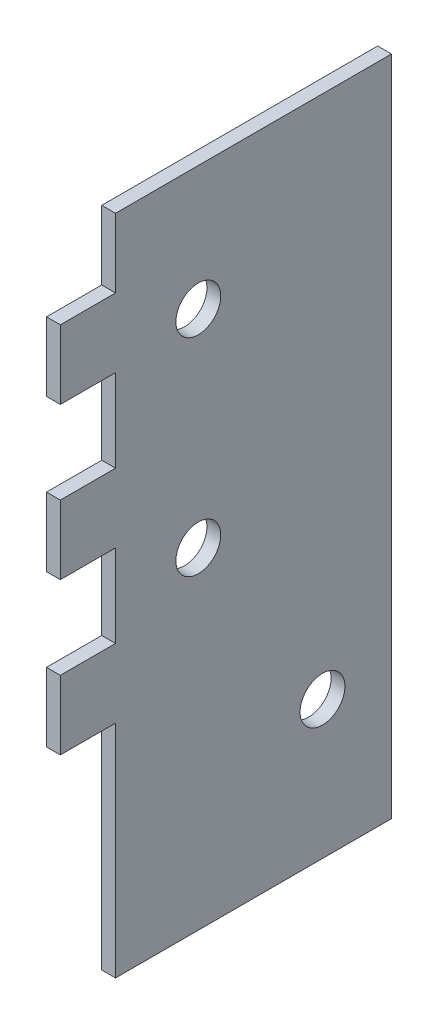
ISO-10303-21;
HEADER;
FILE_DESCRIPTION(('STEP AP214'),'2;1');
FILE_NAME('part.step','',(''),(''),'','','');
FILE_SCHEMA(('AUTOMOTIVE_DESIGN { 1 0 10303 214 1 1 1 1 }'));
ENDSEC;
DATA;
#1=APPLICATION_CONTEXT('core data for automotive mechanical design processes');
#2=APPLICATION_PROTOCOL_DEFINITION('international standard','automotive_design',2000,#1);
#3=PRODUCT_CONTEXT('',#1,'mechanical');
#4=PRODUCT('Part','Part','',(#3));
#5=PRODUCT_RELATED_PRODUCT_CATEGORY('part','',(#4));
#6=PRODUCT_DEFINITION_FORMATION('','',#4);
#7=PRODUCT_DEFINITION_CONTEXT('part definition',#1,'design');
#8=PRODUCT_DEFINITION('design','',#6,#7);
#9=PRODUCT_DEFINITION_SHAPE('','',#8);
#10=(LENGTH_UNIT() NAMED_UNIT(*) SI_UNIT(.MILLI.,.METRE.));
#11=(NAMED_UNIT(*) PLANE_ANGLE_UNIT() SI_UNIT($,.RADIAN.));
#12=(NAMED_UNIT(*) SI_UNIT($,.STERADIAN.) SOLID_ANGLE_UNIT());
#13=UNCERTAINTY_MEASURE_WITH_UNIT(LENGTH_MEASURE(1.E-05),#10,'distance_accuracy_value','');
#14=(GEOMETRIC_REPRESENTATION_CONTEXT(3) GLOBAL_UNCERTAINTY_ASSIGNED_CONTEXT((#13)) GLOBAL_UNIT_ASSIGNED_CONTEXT((#10,
#11,#12)) REPRESENTATION_CONTEXT('',''));
#15=CARTESIAN_POINT('',(0.,0.,0.));
#16=DIRECTION('',(0.,0.,1.));
#17=DIRECTION('',(1.,0.,0.));
#18=AXIS2_PLACEMENT_3D('',#15,#16,#17);
#19=CARTESIAN_POINT('',(-3.17499999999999,304.8,63.5));
#20=DIRECTION('',(0.,0.,-1.));
#21=DIRECTION('',(-1.,0.,0.));
#22=AXIS2_PLACEMENT_3D('',#19,#20,#21);
#23=PLANE('',#22);
#24=DIRECTION('',(1.,0.,0.));
#25=VECTOR('',#24,1.);
#26=CARTESIAN_POINT('',(-3.17499999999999,101.6,63.5));
#27=LINE('',#26,#25);
#28=CARTESIAN_POINT('',(-3.17499999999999,101.6,63.5));
#29=VERTEX_POINT('',#28);
#30=CARTESIAN_POINT('',(3.17500000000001,101.6,63.5));
#31=VERTEX_POINT('',#30);
#32=EDGE_CURVE('E336',#29,#31,#27,.T.);
#33=ORIENTED_EDGE('',*,*,#32,.F.);
#34=DIRECTION('',(0.,-1.,0.));
#35=VECTOR('',#34,1.);
#36=CARTESIAN_POINT('',(-3.17499999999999,304.8,63.5));
#37=LINE('',#36,#35);
#38=CARTESIAN_POINT('',(-3.17499999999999,0.,63.5));
#39=VERTEX_POINT('',#38);
#40=EDGE_CURVE('E170',#29,#39,#37,.T.);
#41=ORIENTED_EDGE('',*,*,#40,.T.);
#42=DIRECTION('',(1.,0.,0.));
#43=VECTOR('',#42,1.);
#44=CARTESIAN_POINT('',(-3.17499999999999,0.,63.5));
#45=LINE('',#44,#43);
#46=CARTESIAN_POINT('',(3.17500000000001,0.,63.5));
#47=VERTEX_POINT('',#46);
#48=EDGE_CURVE('E244',#39,#47,#45,.T.);
#49=ORIENTED_EDGE('',*,*,#48,.T.);
#50=DIRECTION('',(0.,-1.,0.));
#51=VECTOR('',#50,1.);
#52=CARTESIAN_POINT('',(3.17500000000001,304.8,63.5));
#53=LINE('',#52,#51);
#54=EDGE_CURVE('E49',#31,#47,#53,.T.);
#55=ORIENTED_EDGE('',*,*,#54,.F.);
#56=EDGE_LOOP('',(#33,#41,#49,#55));
#57=FACE_BOUND('',#56,.T.);
#58=ADVANCED_FACE('F32',(#57),#23,.F.);
#59=DIRECTION('',(-1.,0.,0.));
#60=VECTOR('',#59,1.);
#61=CARTESIAN_POINT('',(-3.17499999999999,133.35,63.5));
#62=LINE('',#61,#60);
#63=CARTESIAN_POINT('',(3.17500000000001,133.35,63.5));
#64=VERTEX_POINT('',#63);
#65=CARTESIAN_POINT('',(-3.17499999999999,133.35,63.5));
#66=VERTEX_POINT('',#65);
#67=EDGE_CURVE('E57',#64,#66,#62,.T.);
#68=ORIENTED_EDGE('',*,*,#67,.F.);
#69=CARTESIAN_POINT('',(3.17500000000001,171.45,63.5));
#70=VERTEX_POINT('',#69);
#71=EDGE_CURVE('E342',#70,#64,#53,.T.);
#72=ORIENTED_EDGE('',*,*,#71,.F.);
#73=DIRECTION('',(1.,0.,0.));
#74=VECTOR('',#73,1.);
#75=CARTESIAN_POINT('',(-3.17499999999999,171.45,63.5));
#76=LINE('',#75,#74);
#77=CARTESIAN_POINT('',(-3.17499999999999,171.45,63.5));
#78=VERTEX_POINT('',#77);
#79=EDGE_CURVE('E171',#78,#70,#76,.T.);
#80=ORIENTED_EDGE('',*,*,#79,.F.);
#81=EDGE_CURVE('E332',#78,#66,#37,.T.);
#82=ORIENTED_EDGE('',*,*,#81,.T.);
#83=EDGE_LOOP('',(#68,#72,#80,#82));
#84=FACE_BOUND('',#83,.T.);
#85=ADVANCED_FACE('F293',(#84),#23,.F.);
#86=DIRECTION('',(-1.,0.,0.));
#87=VECTOR('',#86,1.);
#88=CARTESIAN_POINT('',(-3.17499999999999,203.2,63.5));
#89=LINE('',#88,#87);
#90=CARTESIAN_POINT('',(3.17500000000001,203.2,63.5));
#91=VERTEX_POINT('',#90);
#92=CARTESIAN_POINT('',(-3.17499999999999,203.2,63.5));
#93=VERTEX_POINT('',#92);
#94=EDGE_CURVE('E174',#91,#93,#89,.T.);
#95=ORIENTED_EDGE('',*,*,#94,.F.);
#96=CARTESIAN_POINT('',(3.17500000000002,241.3,63.5));
#97=VERTEX_POINT('',#96);
#98=EDGE_CURVE('E261',#97,#91,#53,.T.);
#99=ORIENTED_EDGE('',*,*,#98,.F.);
#100=DIRECTION('',(1.,0.,0.));
#101=VECTOR('',#100,1.);
#102=CARTESIAN_POINT('',(-3.17499999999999,241.3,63.5));
#103=LINE('',#102,#101);
#104=CARTESIAN_POINT('',(-3.17499999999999,241.3,63.5));
#105=VERTEX_POINT('',#104);
#106=EDGE_CURVE('E203',#105,#97,#103,.T.);
#107=ORIENTED_EDGE('',*,*,#106,.F.);
#108=EDGE_CURVE('E264',#105,#93,#37,.T.);
#109=ORIENTED_EDGE('',*,*,#108,.T.);
#110=EDGE_LOOP('',(#95,#99,#107,#109));
#111=FACE_BOUND('',#110,.T.);
#112=ADVANCED_FACE('F299',(#111),#23,.F.);
#113=DIRECTION('',(-1.,0.,0.));
#114=VECTOR('',#113,1.);
#115=CARTESIAN_POINT('',(-3.17499999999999,273.05,63.5));
#116=LINE('',#115,#114);
#117=CARTESIAN_POINT('',(3.17500000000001,273.05,63.5));
#118=VERTEX_POINT('',#117);
#119=CARTESIAN_POINT('',(-3.17499999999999,273.05,63.5));
#120=VERTEX_POINT('',#119);
#121=EDGE_CURVE('E208',#118,#120,#116,.T.);
#122=ORIENTED_EDGE('',*,*,#121,.F.);
#123=CARTESIAN_POINT('',(3.17500000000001,304.8,63.5));
#124=VERTEX_POINT('',#123);
#125=EDGE_CURVE('E258',#124,#118,#53,.T.);
#126=ORIENTED_EDGE('',*,*,#125,.F.);
#127=DIRECTION('',(1.,0.,0.));
#128=VECTOR('',#127,1.);
#129=CARTESIAN_POINT('',(-3.17499999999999,304.8,63.5));
#130=LINE('',#129,#128);
#131=CARTESIAN_POINT('',(-3.17499999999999,304.8,63.5));
#132=VERTEX_POINT('',#131);
#133=EDGE_CURVE('E248',#132,#124,#130,.T.);
#134=ORIENTED_EDGE('',*,*,#133,.F.);
#135=EDGE_CURVE('E262',#132,#120,#37,.T.);
#136=ORIENTED_EDGE('',*,*,#135,.T.);
#137=EDGE_LOOP('',(#122,#126,#134,#136));
#138=FACE_BOUND('',#137,.T.);
#139=ADVANCED_FACE('F295',(#138),#23,.F.);
#140=CARTESIAN_POINT('',(3.17499999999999,304.8,-63.5));
#141=DIRECTION('',(-1.,0.,0.));
#142=DIRECTION('',(0.,0.,1.));
#143=AXIS2_PLACEMENT_3D('',#140,#141,#142);
#144=PLANE('',#143);
#145=CARTESIAN_POINT('',(3.175,247.65,25.4));
#146=DIRECTION('',(1.,0.,0.));
#147=DIRECTION('',(0.,0.,-1.));
#148=AXIS2_PLACEMENT_3D('',#145,#146,#147);
#149=CIRCLE('',#148,10.31875);
#150=CARTESIAN_POINT('',(3.17499999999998,247.65,15.08125));
#151=VERTEX_POINT('',#150);
#152=EDGE_CURVE('E231',#151,#151,#149,.T.);
#153=ORIENTED_EDGE('',*,*,#152,.F.);
#154=EDGE_LOOP('',(#153));
#155=FACE_BOUND('',#154,.T.);
#156=CARTESIAN_POINT('',(3.175,152.4,25.4));
#157=DIRECTION('',(1.,0.,0.));
#158=DIRECTION('',(0.,0.,-1.));
#159=AXIS2_PLACEMENT_3D('',#156,#157,#158);
#160=CIRCLE('',#159,10.31875);
#161=CARTESIAN_POINT('',(3.17499999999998,152.4,15.08125));
#162=VERTEX_POINT('',#161);
#163=EDGE_CURVE('E235',#162,#162,#160,.T.);
#164=ORIENTED_EDGE('',*,*,#163,.F.);
#165=EDGE_LOOP('',(#164));
#166=FACE_BOUND('',#165,.T.);
#167=CARTESIAN_POINT('',(3.175,63.5,-31.75));
#168=DIRECTION('',(1.,0.,0.));
#169=DIRECTION('',(0.,0.,-1.));
#170=AXIS2_PLACEMENT_3D('',#167,#168,#169);
#171=CIRCLE('',#170,10.31875);
#172=CARTESIAN_POINT('',(3.17499999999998,63.5,-42.06875));
#173=VERTEX_POINT('',#172);
#174=EDGE_CURVE('E230',#173,#173,#171,.T.);
#175=ORIENTED_EDGE('',*,*,#174,.F.);
#176=EDGE_LOOP('',(#175));
#177=FACE_BOUND('',#176,.T.);
#178=DIRECTION('',(0.,0.,-1.));
#179=VECTOR('',#178,1.);
#180=CARTESIAN_POINT('',(3.17499999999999,0.,-63.5));
#181=LINE('',#180,#179);
#182=CARTESIAN_POINT('',(3.17499999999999,0.,-63.5));
#183=VERTEX_POINT('',#182);
#184=EDGE_CURVE('E250',#47,#183,#181,.T.);
#185=ORIENTED_EDGE('',*,*,#184,.T.);
#186=DIRECTION('',(0.,-1.,0.));
#187=VECTOR('',#186,1.);
#188=CARTESIAN_POINT('',(3.17499999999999,304.8,-63.5));
#189=LINE('',#188,#187);
#190=CARTESIAN_POINT('',(3.17499999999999,304.8,-63.5));
#191=VERTEX_POINT('',#190);
#192=EDGE_CURVE('E11',#191,#183,#189,.T.);
#193=ORIENTED_EDGE('',*,*,#192,.F.);
#194=DIRECTION('',(0.,0.,-1.));
#195=VECTOR('',#194,1.);
#196=CARTESIAN_POINT('',(3.17499999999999,304.8,-63.5));
#197=LINE('',#196,#195);
#198=EDGE_CURVE('E240',#124,#191,#197,.T.);
#199=ORIENTED_EDGE('',*,*,#198,.F.);
#200=ORIENTED_EDGE('',*,*,#125,.T.);
#201=DIRECTION('',(0.,0.,-1.));
#202=VECTOR('',#201,1.);
#203=CARTESIAN_POINT('',(3.17500000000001,273.05,88.9));
#204=LINE('',#203,#202);
#205=CARTESIAN_POINT('',(3.17500000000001,273.05,88.9));
#206=VERTEX_POINT('',#205);
#207=EDGE_CURVE('E221',#206,#118,#204,.T.);
#208=ORIENTED_EDGE('',*,*,#207,.F.);
#209=DIRECTION('',(0.,1.,0.));
#210=VECTOR('',#209,1.);
#211=CARTESIAN_POINT('',(3.17500000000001,273.05,88.9));
#212=LINE('',#211,#210);
#213=CARTESIAN_POINT('',(3.17500000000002,241.3,88.9));
#214=VERTEX_POINT('',#213);
#215=EDGE_CURVE('E210',#214,#206,#212,.T.);
#216=ORIENTED_EDGE('',*,*,#215,.F.);
#217=DIRECTION('',(0.,0.,-1.));
#218=VECTOR('',#217,1.);
#219=CARTESIAN_POINT('',(3.17500000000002,241.3,88.9));
#220=LINE('',#219,#218);
#221=EDGE_CURVE('E224',#214,#97,#220,.T.);
#222=ORIENTED_EDGE('',*,*,#221,.T.);
#223=ORIENTED_EDGE('',*,*,#98,.T.);
#224=DIRECTION('',(0.,0.,-1.));
#225=VECTOR('',#224,1.);
#226=CARTESIAN_POINT('',(3.17500000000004,203.2,88.9));
#227=LINE('',#226,#225);
#228=CARTESIAN_POINT('',(3.17500000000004,203.2,88.9));
#229=VERTEX_POINT('',#228);
#230=EDGE_CURVE('E194',#229,#91,#227,.T.);
#231=ORIENTED_EDGE('',*,*,#230,.F.);
#232=DIRECTION('',(0.,1.,0.));
#233=VECTOR('',#232,1.);
#234=CARTESIAN_POINT('',(3.17500000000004,203.2,88.9));
#235=LINE('',#234,#233);
#236=CARTESIAN_POINT('',(3.17500000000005,171.45,88.9));
#237=VERTEX_POINT('',#236);
#238=EDGE_CURVE('E185',#237,#229,#235,.T.);
#239=ORIENTED_EDGE('',*,*,#238,.F.);
#240=DIRECTION('',(0.,0.,-1.));
#241=VECTOR('',#240,1.);
#242=CARTESIAN_POINT('',(3.17500000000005,171.45,88.9));
#243=LINE('',#242,#241);
#244=EDGE_CURVE('E197',#237,#70,#243,.T.);
#245=ORIENTED_EDGE('',*,*,#244,.T.);
#246=ORIENTED_EDGE('',*,*,#71,.T.);
#247=DIRECTION('',(0.,0.,-1.));
#248=VECTOR('',#247,1.);
#249=CARTESIAN_POINT('',(3.17500000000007,133.35,88.9));
#250=LINE('',#249,#248);
#251=CARTESIAN_POINT('',(3.17500000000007,133.35,88.9));
#252=VERTEX_POINT('',#251);
#253=EDGE_CURVE('E176',#252,#64,#250,.T.);
#254=ORIENTED_EDGE('',*,*,#253,.F.);
#255=DIRECTION('',(0.,1.,0.));
#256=VECTOR('',#255,1.);
#257=CARTESIAN_POINT('',(3.17500000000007,133.35,88.9));
#258=LINE('',#257,#256);
#259=CARTESIAN_POINT('',(3.17500000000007,101.6,88.9));
#260=VERTEX_POINT('',#259);
#261=EDGE_CURVE('E157',#260,#252,#258,.T.);
#262=ORIENTED_EDGE('',*,*,#261,.F.);
#263=DIRECTION('',(0.,0.,-1.));
#264=VECTOR('',#263,1.);
#265=CARTESIAN_POINT('',(3.17500000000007,101.6,88.9));
#266=LINE('',#265,#264);
#267=EDGE_CURVE('E154',#260,#31,#266,.T.);
#268=ORIENTED_EDGE('',*,*,#267,.T.);
#269=ORIENTED_EDGE('',*,*,#54,.T.);
#270=EDGE_LOOP('',(#185,#193,#199,#200,#208,#216,#222,#223,#231,#239,#245,#246,#254,#262,#268,#269));
#271=FACE_BOUND('',#270,.T.);
#272=ADVANCED_FACE('F34',(#155,#166,#177,#271),#144,.F.);
#273=CARTESIAN_POINT('',(-3.17500000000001,304.8,-63.5));
#274=DIRECTION('',(0.,0.,1.));
#275=DIRECTION('',(1.,0.,0.));
#276=AXIS2_PLACEMENT_3D('',#273,#274,#275);
#277=PLANE('',#276);
#278=DIRECTION('',(-1.,0.,0.));
#279=VECTOR('',#278,1.);
#280=CARTESIAN_POINT('',(-3.17500000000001,0.,-63.5));
#281=LINE('',#280,#279);
#282=CARTESIAN_POINT('',(-3.17500000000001,0.,-63.5));
#283=VERTEX_POINT('',#282);
#284=EDGE_CURVE('E253',#183,#283,#281,.T.);
#285=ORIENTED_EDGE('',*,*,#284,.T.);
#286=DIRECTION('',(0.,-1.,0.));
#287=VECTOR('',#286,1.);
#288=CARTESIAN_POINT('',(-3.17500000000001,304.8,-63.5));
#289=LINE('',#288,#287);
#290=CARTESIAN_POINT('',(-3.17500000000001,304.8,-63.5));
#291=VERTEX_POINT('',#290);
#292=EDGE_CURVE('E41',#291,#283,#289,.T.);
#293=ORIENTED_EDGE('',*,*,#292,.F.);
#294=DIRECTION('',(-1.,0.,0.));
#295=VECTOR('',#294,1.);
#296=CARTESIAN_POINT('',(-3.17500000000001,304.8,-63.5));
#297=LINE('',#296,#295);
#298=EDGE_CURVE('E243',#191,#291,#297,.T.);
#299=ORIENTED_EDGE('',*,*,#298,.F.);
#300=ORIENTED_EDGE('',*,*,#192,.T.);
#301=EDGE_LOOP('',(#285,#293,#299,#300));
#302=FACE_BOUND('',#301,.T.);
#303=ADVANCED_FACE('F308',(#302),#277,.F.);
#304=CARTESIAN_POINT('',(-3.17500000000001,304.8,-63.5));
#305=DIRECTION('',(1.,0.,0.));
#306=DIRECTION('',(0.,0.,-1.));
#307=AXIS2_PLACEMENT_3D('',#304,#305,#306);
#308=PLANE('',#307);
#309=CARTESIAN_POINT('',(-3.17500000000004,247.65,25.4));
#310=DIRECTION('',(1.,0.,0.));
#311=DIRECTION('',(0.,0.,-1.));
#312=AXIS2_PLACEMENT_3D('',#309,#310,#311);
#313=CIRCLE('',#312,10.31875);
#314=CARTESIAN_POINT('',(-3.17500000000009,247.65,15.08125));
#315=VERTEX_POINT('',#314);
#316=EDGE_CURVE('E36',#315,#315,#313,.T.);
#317=ORIENTED_EDGE('',*,*,#316,.T.);
#318=EDGE_LOOP('',(#317));
#319=FACE_BOUND('',#318,.T.);
#320=CARTESIAN_POINT('',(-3.17500000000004,152.4,25.4));
#321=DIRECTION('',(1.,0.,0.));
#322=DIRECTION('',(0.,0.,-1.));
#323=AXIS2_PLACEMENT_3D('',#320,#321,#322);
#324=CIRCLE('',#323,10.31875);
#325=CARTESIAN_POINT('',(-3.17500000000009,152.4,15.08125));
#326=VERTEX_POINT('',#325);
#327=EDGE_CURVE('E268',#326,#326,#324,.T.);
#328=ORIENTED_EDGE('',*,*,#327,.T.);
#329=EDGE_LOOP('',(#328));
#330=FACE_BOUND('',#329,.T.);
#331=CARTESIAN_POINT('',(-3.17500000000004,63.5,-31.75));
#332=DIRECTION('',(1.,0.,0.));
#333=DIRECTION('',(0.,0.,-1.));
#334=AXIS2_PLACEMENT_3D('',#331,#332,#333);
#335=CIRCLE('',#334,10.31875);
#336=CARTESIAN_POINT('',(-3.17500000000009,63.5,-42.06875));
#337=VERTEX_POINT('',#336);
#338=EDGE_CURVE('E234',#337,#337,#335,.T.);
#339=ORIENTED_EDGE('',*,*,#338,.T.);
#340=EDGE_LOOP('',(#339));
#341=FACE_BOUND('',#340,.T.);
#342=DIRECTION('',(0.,0.,1.));
#343=VECTOR('',#342,1.);
#344=CARTESIAN_POINT('',(-3.17500000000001,0.,-63.5));
#345=LINE('',#344,#343);
#346=EDGE_CURVE('E255',#283,#39,#345,.T.);
#347=ORIENTED_EDGE('',*,*,#346,.T.);
#348=ORIENTED_EDGE('',*,*,#40,.F.);
#349=DIRECTION('',(0.,0.,-1.));
#350=VECTOR('',#349,1.);
#351=CARTESIAN_POINT('',(-3.17499999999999,101.6,88.9));
#352=LINE('',#351,#350);
#353=CARTESIAN_POINT('',(-3.17499999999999,101.6,88.9));
#354=VERTEX_POINT('',#353);
#355=EDGE_CURVE('E152',#354,#29,#352,.T.);
#356=ORIENTED_EDGE('',*,*,#355,.F.);
#357=DIRECTION('',(0.,-1.,0.));
#358=VECTOR('',#357,1.);
#359=CARTESIAN_POINT('',(-3.17499999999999,133.35,88.9));
#360=LINE('',#359,#358);
#361=CARTESIAN_POINT('',(-3.17499999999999,133.35,88.9));
#362=VERTEX_POINT('',#361);
#363=EDGE_CURVE('E158',#362,#354,#360,.T.);
#364=ORIENTED_EDGE('',*,*,#363,.F.);
#365=DIRECTION('',(0.,0.,-1.));
#366=VECTOR('',#365,1.);
#367=CARTESIAN_POINT('',(-3.17499999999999,133.35,88.9));
#368=LINE('',#367,#366);
#369=EDGE_CURVE('E349',#362,#66,#368,.T.);
#370=ORIENTED_EDGE('',*,*,#369,.T.);
#371=ORIENTED_EDGE('',*,*,#81,.F.);
#372=DIRECTION('',(0.,0.,-1.));
#373=VECTOR('',#372,1.);
#374=CARTESIAN_POINT('',(-3.17499999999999,171.45,88.9));
#375=LINE('',#374,#373);
#376=CARTESIAN_POINT('',(-3.17499999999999,171.45,88.9));
#377=VERTEX_POINT('',#376);
#378=EDGE_CURVE('E200',#377,#78,#375,.T.);
#379=ORIENTED_EDGE('',*,*,#378,.F.);
#380=DIRECTION('',(0.,-1.,0.));
#381=VECTOR('',#380,1.);
#382=CARTESIAN_POINT('',(-3.17499999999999,203.2,88.9));
#383=LINE('',#382,#381);
#384=CARTESIAN_POINT('',(-3.17499999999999,203.2,88.9));
#385=VERTEX_POINT('',#384);
#386=EDGE_CURVE('E180',#385,#377,#383,.T.);
#387=ORIENTED_EDGE('',*,*,#386,.F.);
#388=DIRECTION('',(0.,0.,-1.));
#389=VECTOR('',#388,1.);
#390=CARTESIAN_POINT('',(-3.17499999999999,203.2,88.9));
#391=LINE('',#390,#389);
#392=EDGE_CURVE('E188',#385,#93,#391,.T.);
#393=ORIENTED_EDGE('',*,*,#392,.T.);
#394=ORIENTED_EDGE('',*,*,#108,.F.);
#395=DIRECTION('',(0.,0.,-1.));
#396=VECTOR('',#395,1.);
#397=CARTESIAN_POINT('',(-3.17499999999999,241.3,88.9));
#398=LINE('',#397,#396);
#399=CARTESIAN_POINT('',(-3.17499999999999,241.3,88.9));
#400=VERTEX_POINT('',#399);
#401=EDGE_CURVE('E227',#400,#105,#398,.T.);
#402=ORIENTED_EDGE('',*,*,#401,.F.);
#403=DIRECTION('',(0.,-1.,0.));
#404=VECTOR('',#403,1.);
#405=CARTESIAN_POINT('',(-3.17499999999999,273.05,88.9));
#406=LINE('',#405,#404);
#407=CARTESIAN_POINT('',(-3.17499999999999,273.05,88.9));
#408=VERTEX_POINT('',#407);
#409=EDGE_CURVE('E204',#408,#400,#406,.T.);
#410=ORIENTED_EDGE('',*,*,#409,.F.);
#411=DIRECTION('',(0.,0.,-1.));
#412=VECTOR('',#411,1.);
#413=CARTESIAN_POINT('',(-3.17499999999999,273.05,88.9));
#414=LINE('',#413,#412);
#415=EDGE_CURVE('E214',#408,#120,#414,.T.);
#416=ORIENTED_EDGE('',*,*,#415,.T.);
#417=ORIENTED_EDGE('',*,*,#135,.F.);
#418=DIRECTION('',(0.,0.,1.));
#419=VECTOR('',#418,1.);
#420=CARTESIAN_POINT('',(-3.17500000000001,304.8,-63.5));
#421=LINE('',#420,#419);
#422=EDGE_CURVE('E246',#291,#132,#421,.T.);
#423=ORIENTED_EDGE('',*,*,#422,.F.);
#424=ORIENTED_EDGE('',*,*,#292,.T.);
#425=EDGE_LOOP('',(#347,#348,#356,#364,#370,#371,#379,#387,#393,#394,#402,#410,#416,#417,#423,#424));
#426=FACE_BOUND('',#425,.T.);
#427=ADVANCED_FACE('F169',(#319,#330,#341,#426),#308,.F.);
#428=CARTESIAN_POINT('',(0.,304.8,0.));
#429=DIRECTION('',(0.,1.,0.));
#430=DIRECTION('',(0.,0.,1.));
#431=AXIS2_PLACEMENT_3D('',#428,#429,#430);
#432=PLANE('',#431);
#433=ORIENTED_EDGE('',*,*,#198,.T.);
#434=ORIENTED_EDGE('',*,*,#298,.T.);
#435=ORIENTED_EDGE('',*,*,#422,.T.);
#436=ORIENTED_EDGE('',*,*,#133,.T.);
#437=EDGE_LOOP('',(#433,#434,#435,#436));
#438=FACE_BOUND('',#437,.T.);
#439=ADVANCED_FACE('F439',(#438),#432,.T.);
#440=CARTESIAN_POINT('',(0.,0.,0.));
#441=DIRECTION('',(0.,1.,0.));
#442=DIRECTION('',(0.,0.,1.));
#443=AXIS2_PLACEMENT_3D('',#440,#441,#442);
#444=PLANE('',#443);
#445=ORIENTED_EDGE('',*,*,#184,.F.);
#446=ORIENTED_EDGE('',*,*,#48,.F.);
#447=ORIENTED_EDGE('',*,*,#346,.F.);
#448=ORIENTED_EDGE('',*,*,#284,.F.);
#449=EDGE_LOOP('',(#445,#446,#447,#448));
#450=FACE_BOUND('',#449,.T.);
#451=ADVANCED_FACE('F341',(#450),#444,.F.);
#452=CARTESIAN_POINT('',(-301.625,63.5,-31.75));
#453=DIRECTION('',(1.,0.,0.));
#454=DIRECTION('',(0.,0.,-1.));
#455=AXIS2_PLACEMENT_3D('',#452,#453,#454);
#456=CYLINDRICAL_SURFACE('',#455,10.31875);
#457=CARTESIAN_POINT('',(3.17499999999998,63.5,-42.06875));
#458=CARTESIAN_POINT('',(3.10885416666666,63.5,-42.06875));
#459=CARTESIAN_POINT('',(3.04270833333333,63.5,-42.06875));
#460=CARTESIAN_POINT('',(2.91041666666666,63.5,-42.06875));
#461=CARTESIAN_POINT('',(2.84427083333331,63.5,-42.06875));
#462=CARTESIAN_POINT('',(2.71197916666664,63.5,-42.06875));
#463=CARTESIAN_POINT('',(2.64583333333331,63.5,-42.06875));
#464=CARTESIAN_POINT('',(2.51354166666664,63.5,-42.06875));
#465=CARTESIAN_POINT('',(2.44739583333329,63.5,-42.06875));
#466=CARTESIAN_POINT('',(2.31510416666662,63.5,-42.06875));
#467=CARTESIAN_POINT('',(2.24895833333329,63.5,-42.06875));
#468=CARTESIAN_POINT('',(2.11666666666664,63.5,-42.06875));
#469=CARTESIAN_POINT('',(2.05052083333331,63.5,-42.06875));
#470=CARTESIAN_POINT('',(1.91822916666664,63.5,-42.06875));
#471=CARTESIAN_POINT('',(1.85208333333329,63.5,-42.06875));
#472=CARTESIAN_POINT('',(1.71979166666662,63.5,-42.06875));
#473=CARTESIAN_POINT('',(1.65364583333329,63.5,-42.06875));
#474=CARTESIAN_POINT('',(1.52135416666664,63.5,-42.06875));
#475=CARTESIAN_POINT('',(1.45520833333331,63.5,-42.06875));
#476=CARTESIAN_POINT('',(1.32291666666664,63.5,-42.06875));
#477=CARTESIAN_POINT('',(1.25677083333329,63.5,-42.06875));
#478=CARTESIAN_POINT('',(1.12447916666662,63.5,-42.06875));
#479=CARTESIAN_POINT('',(1.05833333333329,63.5,-42.06875));
#480=CARTESIAN_POINT('',(0.926041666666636,63.5,-42.06875));
#481=CARTESIAN_POINT('',(0.859895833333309,63.5,-42.06875));
#482=CARTESIAN_POINT('',(0.727604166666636,63.5,-42.06875));
#483=CARTESIAN_POINT('',(0.661458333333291,63.5,-42.06875));
#484=CARTESIAN_POINT('',(0.529166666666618,63.5,-42.06875));
#485=CARTESIAN_POINT('',(0.46302083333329,63.5,-42.06875));
#486=CARTESIAN_POINT('',(0.330729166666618,63.5,-42.06875));
#487=CARTESIAN_POINT('',(0.264583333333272,63.5,-42.06875));
#488=CARTESIAN_POINT('',(0.132291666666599,63.5,-42.06875));
#489=CARTESIAN_POINT('',(0.0661458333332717,63.5,-42.06875));
#490=CARTESIAN_POINT('',(-0.0661458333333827,63.5,-42.06875));
#491=CARTESIAN_POINT('',(-0.13229166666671,63.5,-42.06875));
#492=CARTESIAN_POINT('',(-0.264583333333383,63.5,-42.06875));
#493=CARTESIAN_POINT('',(-0.330729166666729,63.5,-42.06875));
#494=CARTESIAN_POINT('',(-0.463020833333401,63.5,-42.06875));
#495=CARTESIAN_POINT('',(-0.529166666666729,63.5,-42.06875));
#496=CARTESIAN_POINT('',(-0.661458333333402,63.5,-42.06875));
#497=CARTESIAN_POINT('',(-0.727604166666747,63.5,-42.06875));
#498=CARTESIAN_POINT('',(-0.85989583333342,63.5,-42.06875));
#499=CARTESIAN_POINT('',(-0.926041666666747,63.5,-42.06875));
#500=CARTESIAN_POINT('',(-1.0583333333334,63.5,-42.06875));
#501=CARTESIAN_POINT('',(-1.12447916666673,63.5,-42.06875));
#502=CARTESIAN_POINT('',(-1.2567708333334,63.5,-42.06875));
#503=CARTESIAN_POINT('',(-1.32291666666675,63.5,-42.06875));
#504=CARTESIAN_POINT('',(-1.45520833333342,63.5,-42.06875));
#505=CARTESIAN_POINT('',(-1.52135416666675,63.5,-42.06875));
#506=CARTESIAN_POINT('',(-1.6536458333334,63.5,-42.06875));
#507=CARTESIAN_POINT('',(-1.71979166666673,63.5,-42.06875));
#508=CARTESIAN_POINT('',(-1.8520833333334,63.5,-42.06875));
#509=CARTESIAN_POINT('',(-1.91822916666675,63.5,-42.06875));
#510=CARTESIAN_POINT('',(-2.05052083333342,63.5,-42.06875));
#511=CARTESIAN_POINT('',(-2.11666666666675,63.5,-42.06875));
#512=CARTESIAN_POINT('',(-2.2489583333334,63.5,-42.06875));
#513=CARTESIAN_POINT('',(-2.31510416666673,63.5,-42.06875));
#514=CARTESIAN_POINT('',(-2.4473958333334,63.5,-42.06875));
#515=CARTESIAN_POINT('',(-2.51354166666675,63.5,-42.06875));
#516=CARTESIAN_POINT('',(-2.64583333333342,63.5,-42.06875));
#517=CARTESIAN_POINT('',(-2.71197916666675,63.5,-42.06875));
#518=CARTESIAN_POINT('',(-2.84427083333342,63.5,-42.06875));
#519=CARTESIAN_POINT('',(-2.91041666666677,63.5,-42.06875));
#520=CARTESIAN_POINT('',(-3.04270833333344,63.5,-42.06875));
#521=CARTESIAN_POINT('',(-3.10885416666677,63.5,-42.06875));
#522=CARTESIAN_POINT('',(-3.17500000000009,63.5,-42.06875));
#523=B_SPLINE_CURVE_WITH_KNOTS('',3,(#457,#458,#459,#460,#461,#462,#463,#464,#465,#466,#467,
#468,#469,#470,#471,#472,#473,#474,#475,#476,#477,#478,#479,#480,#481,#482,#483,#484,#485,#486,
#487,#488,#489,#490,#491,#492,#493,#494,#495,#496,#497,#498,#499,#500,#501,#502,#503,#504,#505,
#506,#507,#508,#509,#510,#511,#512,#513,#514,#515,#516,#517,#518,#519,#520,#521,#522),
.UNSPECIFIED.,.F.,.F.,(4,2,2,2,2,2,2,2,2,2,2,2,2,2,2,2,2,2,2,2,2,2,2,2,2,2,2,2,2,2,2,2,4),(0.,
0.198437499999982,0.396875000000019,0.5953125,0.793750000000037,0.992187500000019,1.190625,
1.38906250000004,1.58750000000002,1.7859375,1.98437500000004,2.18281250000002,2.38125,
2.57968750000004,2.77812500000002,2.97656250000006,3.17500000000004,3.37343750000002,
3.57187500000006,3.77031250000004,3.96875000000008,4.16718750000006,4.36562500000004,
4.56406250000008,4.76250000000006,4.96093750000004,5.15937500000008,5.35781250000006,
5.55625000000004,5.75468750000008,5.95312500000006,6.1515625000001,6.35000000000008),.UNSPECIFIED.);
#524=EDGE_CURVE('BSEAM289',#173,#337,#523,.T.);
#525=ORIENTED_EDGE('',*,*,#174,.T.);
#526=ORIENTED_EDGE('',*,*,#338,.F.);
#527=ORIENTED_EDGE('',*,*,#524,.T.);
#528=ORIENTED_EDGE('',*,*,#524,.F.);
#529=EDGE_LOOP('',(#525,#527,#526,#528));
#530=FACE_BOUND('',#529,.T.);
#531=ADVANCED_FACE('F289',(#530),#456,.F.);
#532=CARTESIAN_POINT('',(-301.625,152.4,25.4));
#533=DIRECTION('',(1.,0.,0.));
#534=DIRECTION('',(0.,0.,-1.));
#535=AXIS2_PLACEMENT_3D('',#532,#533,#534);
#536=CYLINDRICAL_SURFACE('',#535,10.31875);
#537=CARTESIAN_POINT('',(3.17499999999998,152.4,15.08125));
#538=CARTESIAN_POINT('',(3.10885416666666,152.4,15.08125));
#539=CARTESIAN_POINT('',(3.04270833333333,152.4,15.08125));
#540=CARTESIAN_POINT('',(2.91041666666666,152.4,15.08125));
#541=CARTESIAN_POINT('',(2.84427083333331,152.4,15.08125));
#542=CARTESIAN_POINT('',(2.71197916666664,152.4,15.08125));
#543=CARTESIAN_POINT('',(2.64583333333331,152.4,15.08125));
#544=CARTESIAN_POINT('',(2.51354166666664,152.4,15.08125));
#545=CARTESIAN_POINT('',(2.44739583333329,152.4,15.08125));
#546=CARTESIAN_POINT('',(2.31510416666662,152.4,15.08125));
#547=CARTESIAN_POINT('',(2.24895833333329,152.4,15.08125));
#548=CARTESIAN_POINT('',(2.11666666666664,152.4,15.08125));
#549=CARTESIAN_POINT('',(2.05052083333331,152.4,15.08125));
#550=CARTESIAN_POINT('',(1.91822916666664,152.4,15.08125));
#551=CARTESIAN_POINT('',(1.85208333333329,152.4,15.08125));
#552=CARTESIAN_POINT('',(1.71979166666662,152.4,15.08125));
#553=CARTESIAN_POINT('',(1.65364583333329,152.4,15.08125));
#554=CARTESIAN_POINT('',(1.52135416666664,152.4,15.08125));
#555=CARTESIAN_POINT('',(1.45520833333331,152.4,15.08125));
#556=CARTESIAN_POINT('',(1.32291666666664,152.4,15.08125));
#557=CARTESIAN_POINT('',(1.25677083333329,152.4,15.08125));
#558=CARTESIAN_POINT('',(1.12447916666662,152.4,15.08125));
#559=CARTESIAN_POINT('',(1.05833333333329,152.4,15.08125));
#560=CARTESIAN_POINT('',(0.926041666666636,152.4,15.08125));
#561=CARTESIAN_POINT('',(0.859895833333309,152.4,15.08125));
#562=CARTESIAN_POINT('',(0.727604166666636,152.4,15.08125));
#563=CARTESIAN_POINT('',(0.661458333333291,152.4,15.08125));
#564=CARTESIAN_POINT('',(0.529166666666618,152.4,15.08125));
#565=CARTESIAN_POINT('',(0.46302083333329,152.4,15.08125));
#566=CARTESIAN_POINT('',(0.330729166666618,152.4,15.08125));
#567=CARTESIAN_POINT('',(0.264583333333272,152.4,15.08125));
#568=CARTESIAN_POINT('',(0.132291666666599,152.4,15.08125));
#569=CARTESIAN_POINT('',(0.0661458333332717,152.4,15.08125));
#570=CARTESIAN_POINT('',(-0.0661458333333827,152.4,15.08125));
#571=CARTESIAN_POINT('',(-0.13229166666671,152.4,15.08125));
#572=CARTESIAN_POINT('',(-0.264583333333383,152.4,15.08125));
#573=CARTESIAN_POINT('',(-0.330729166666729,152.4,15.08125));
#574=CARTESIAN_POINT('',(-0.463020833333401,152.4,15.08125));
#575=CARTESIAN_POINT('',(-0.529166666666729,152.4,15.08125));
#576=CARTESIAN_POINT('',(-0.661458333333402,152.4,15.08125));
#577=CARTESIAN_POINT('',(-0.727604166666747,152.4,15.08125));
#578=CARTESIAN_POINT('',(-0.85989583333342,152.4,15.08125));
#579=CARTESIAN_POINT('',(-0.926041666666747,152.4,15.08125));
#580=CARTESIAN_POINT('',(-1.0583333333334,152.4,15.08125));
#581=CARTESIAN_POINT('',(-1.12447916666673,152.4,15.08125));
#582=CARTESIAN_POINT('',(-1.2567708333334,152.4,15.08125));
#583=CARTESIAN_POINT('',(-1.32291666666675,152.4,15.08125));
#584=CARTESIAN_POINT('',(-1.45520833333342,152.4,15.08125));
#585=CARTESIAN_POINT('',(-1.52135416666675,152.4,15.08125));
#586=CARTESIAN_POINT('',(-1.6536458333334,152.4,15.08125));
#587=CARTESIAN_POINT('',(-1.71979166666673,152.4,15.08125));
#588=CARTESIAN_POINT('',(-1.8520833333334,152.4,15.08125));
#589=CARTESIAN_POINT('',(-1.91822916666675,152.4,15.08125));
#590=CARTESIAN_POINT('',(-2.05052083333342,152.4,15.08125));
#591=CARTESIAN_POINT('',(-2.11666666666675,152.4,15.08125));
#592=CARTESIAN_POINT('',(-2.2489583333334,152.4,15.08125));
#593=CARTESIAN_POINT('',(-2.31510416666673,152.4,15.08125));
#594=CARTESIAN_POINT('',(-2.4473958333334,152.4,15.08125));
#595=CARTESIAN_POINT('',(-2.51354166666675,152.4,15.08125));
#596=CARTESIAN_POINT('',(-2.64583333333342,152.4,15.08125));
#597=CARTESIAN_POINT('',(-2.71197916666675,152.4,15.08125));
#598=CARTESIAN_POINT('',(-2.84427083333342,152.4,15.08125));
#599=CARTESIAN_POINT('',(-2.91041666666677,152.4,15.08125));
#600=CARTESIAN_POINT('',(-3.04270833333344,152.4,15.08125));
#601=CARTESIAN_POINT('',(-3.10885416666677,152.4,15.08125));
#602=CARTESIAN_POINT('',(-3.17500000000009,152.4,15.08125));
#603=B_SPLINE_CURVE_WITH_KNOTS('',3,(#537,#538,#539,#540,#541,#542,#543,#544,#545,#546,#547,
#548,#549,#550,#551,#552,#553,#554,#555,#556,#557,#558,#559,#560,#561,#562,#563,#564,#565,#566,
#567,#568,#569,#570,#571,#572,#573,#574,#575,#576,#577,#578,#579,#580,#581,#582,#583,#584,#585,
#586,#587,#588,#589,#590,#591,#592,#593,#594,#595,#596,#597,#598,#599,#600,#601,#602),
.UNSPECIFIED.,.F.,.F.,(4,2,2,2,2,2,2,2,2,2,2,2,2,2,2,2,2,2,2,2,2,2,2,2,2,2,2,2,2,2,2,2,4),(0.,
0.198437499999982,0.396875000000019,0.5953125,0.793750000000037,0.992187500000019,1.190625,
1.38906250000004,1.58750000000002,1.7859375,1.98437500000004,2.18281250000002,2.38125,
2.57968750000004,2.77812500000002,2.97656250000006,3.17500000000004,3.37343750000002,
3.57187500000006,3.77031250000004,3.96875000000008,4.16718750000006,4.36562500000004,
4.56406250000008,4.76250000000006,4.96093750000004,5.15937500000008,5.35781250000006,
5.55625000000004,5.75468750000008,5.95312500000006,6.1515625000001,6.35000000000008),.UNSPECIFIED.);
#604=EDGE_CURVE('BSEAM279',#162,#326,#603,.T.);
#605=ORIENTED_EDGE('',*,*,#163,.T.);
#606=ORIENTED_EDGE('',*,*,#327,.F.);
#607=ORIENTED_EDGE('',*,*,#604,.T.);
#608=ORIENTED_EDGE('',*,*,#604,.F.);
#609=EDGE_LOOP('',(#605,#607,#606,#608));
#610=FACE_BOUND('',#609,.T.);
#611=ADVANCED_FACE('F279',(#610),#536,.F.);
#612=CARTESIAN_POINT('',(-301.625,247.65,25.4));
#613=DIRECTION('',(1.,0.,0.));
#614=DIRECTION('',(0.,0.,-1.));
#615=AXIS2_PLACEMENT_3D('',#612,#613,#614);
#616=CYLINDRICAL_SURFACE('',#615,10.31875);
#617=CARTESIAN_POINT('',(3.17499999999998,247.65,15.08125));
#618=CARTESIAN_POINT('',(3.10885416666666,247.65,15.08125));
#619=CARTESIAN_POINT('',(3.04270833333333,247.65,15.08125));
#620=CARTESIAN_POINT('',(2.91041666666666,247.65,15.08125));
#621=CARTESIAN_POINT('',(2.84427083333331,247.65,15.08125));
#622=CARTESIAN_POINT('',(2.71197916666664,247.65,15.08125));
#623=CARTESIAN_POINT('',(2.64583333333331,247.65,15.08125));
#624=CARTESIAN_POINT('',(2.51354166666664,247.65,15.08125));
#625=CARTESIAN_POINT('',(2.44739583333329,247.65,15.08125));
#626=CARTESIAN_POINT('',(2.31510416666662,247.65,15.08125));
#627=CARTESIAN_POINT('',(2.24895833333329,247.65,15.08125));
#628=CARTESIAN_POINT('',(2.11666666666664,247.65,15.08125));
#629=CARTESIAN_POINT('',(2.05052083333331,247.65,15.08125));
#630=CARTESIAN_POINT('',(1.91822916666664,247.65,15.08125));
#631=CARTESIAN_POINT('',(1.85208333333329,247.65,15.08125));
#632=CARTESIAN_POINT('',(1.71979166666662,247.65,15.08125));
#633=CARTESIAN_POINT('',(1.65364583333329,247.65,15.08125));
#634=CARTESIAN_POINT('',(1.52135416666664,247.65,15.08125));
#635=CARTESIAN_POINT('',(1.45520833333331,247.65,15.08125));
#636=CARTESIAN_POINT('',(1.32291666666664,247.65,15.08125));
#637=CARTESIAN_POINT('',(1.25677083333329,247.65,15.08125));
#638=CARTESIAN_POINT('',(1.12447916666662,247.65,15.08125));
#639=CARTESIAN_POINT('',(1.05833333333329,247.65,15.08125));
#640=CARTESIAN_POINT('',(0.926041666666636,247.65,15.08125));
#641=CARTESIAN_POINT('',(0.859895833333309,247.65,15.08125));
#642=CARTESIAN_POINT('',(0.727604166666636,247.65,15.08125));
#643=CARTESIAN_POINT('',(0.661458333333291,247.65,15.08125));
#644=CARTESIAN_POINT('',(0.529166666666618,247.65,15.08125));
#645=CARTESIAN_POINT('',(0.46302083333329,247.65,15.08125));
#646=CARTESIAN_POINT('',(0.330729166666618,247.65,15.08125));
#647=CARTESIAN_POINT('',(0.264583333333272,247.65,15.08125));
#648=CARTESIAN_POINT('',(0.132291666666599,247.65,15.08125));
#649=CARTESIAN_POINT('',(0.0661458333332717,247.65,15.08125));
#650=CARTESIAN_POINT('',(-0.0661458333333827,247.65,15.08125));
#651=CARTESIAN_POINT('',(-0.13229166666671,247.65,15.08125));
#652=CARTESIAN_POINT('',(-0.264583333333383,247.65,15.08125));
#653=CARTESIAN_POINT('',(-0.330729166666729,247.65,15.08125));
#654=CARTESIAN_POINT('',(-0.463020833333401,247.65,15.08125));
#655=CARTESIAN_POINT('',(-0.529166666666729,247.65,15.08125));
#656=CARTESIAN_POINT('',(-0.661458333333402,247.65,15.08125));
#657=CARTESIAN_POINT('',(-0.727604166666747,247.65,15.08125));
#658=CARTESIAN_POINT('',(-0.85989583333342,247.65,15.08125));
#659=CARTESIAN_POINT('',(-0.926041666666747,247.65,15.08125));
#660=CARTESIAN_POINT('',(-1.0583333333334,247.65,15.08125));
#661=CARTESIAN_POINT('',(-1.12447916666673,247.65,15.08125));
#662=CARTESIAN_POINT('',(-1.2567708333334,247.65,15.08125));
#663=CARTESIAN_POINT('',(-1.32291666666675,247.65,15.08125));
#664=CARTESIAN_POINT('',(-1.45520833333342,247.65,15.08125));
#665=CARTESIAN_POINT('',(-1.52135416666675,247.65,15.08125));
#666=CARTESIAN_POINT('',(-1.6536458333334,247.65,15.08125));
#667=CARTESIAN_POINT('',(-1.71979166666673,247.65,15.08125));
#668=CARTESIAN_POINT('',(-1.8520833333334,247.65,15.08125));
#669=CARTESIAN_POINT('',(-1.91822916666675,247.65,15.08125));
#670=CARTESIAN_POINT('',(-2.05052083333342,247.65,15.08125));
#671=CARTESIAN_POINT('',(-2.11666666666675,247.65,15.08125));
#672=CARTESIAN_POINT('',(-2.2489583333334,247.65,15.08125));
#673=CARTESIAN_POINT('',(-2.31510416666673,247.65,15.08125));
#674=CARTESIAN_POINT('',(-2.4473958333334,247.65,15.08125));
#675=CARTESIAN_POINT('',(-2.51354166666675,247.65,15.08125));
#676=CARTESIAN_POINT('',(-2.64583333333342,247.65,15.08125));
#677=CARTESIAN_POINT('',(-2.71197916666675,247.65,15.08125));
#678=CARTESIAN_POINT('',(-2.84427083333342,247.65,15.08125));
#679=CARTESIAN_POINT('',(-2.91041666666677,247.65,15.08125));
#680=CARTESIAN_POINT('',(-3.04270833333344,247.65,15.08125));
#681=CARTESIAN_POINT('',(-3.10885416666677,247.65,15.08125));
#682=CARTESIAN_POINT('',(-3.17500000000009,247.65,15.08125));
#683=B_SPLINE_CURVE_WITH_KNOTS('',3,(#617,#618,#619,#620,#621,#622,#623,#624,#625,#626,#627,
#628,#629,#630,#631,#632,#633,#634,#635,#636,#637,#638,#639,#640,#641,#642,#643,#644,#645,#646,
#647,#648,#649,#650,#651,#652,#653,#654,#655,#656,#657,#658,#659,#660,#661,#662,#663,#664,#665,
#666,#667,#668,#669,#670,#671,#672,#673,#674,#675,#676,#677,#678,#679,#680,#681,#682),
.UNSPECIFIED.,.F.,.F.,(4,2,2,2,2,2,2,2,2,2,2,2,2,2,2,2,2,2,2,2,2,2,2,2,2,2,2,2,2,2,2,2,4),(0.,
0.198437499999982,0.396875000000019,0.5953125,0.793750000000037,0.992187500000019,1.190625,
1.38906250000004,1.58750000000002,1.7859375,1.98437500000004,2.18281250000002,2.38125,
2.57968750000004,2.77812500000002,2.97656250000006,3.17500000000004,3.37343750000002,
3.57187500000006,3.77031250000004,3.96875000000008,4.16718750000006,4.36562500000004,
4.56406250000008,4.76250000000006,4.96093750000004,5.15937500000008,5.35781250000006,
5.55625000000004,5.75468750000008,5.95312500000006,6.1515625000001,6.35000000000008),.UNSPECIFIED.);
#684=EDGE_CURVE('BSEAM276',#151,#315,#683,.T.);
#685=ORIENTED_EDGE('',*,*,#152,.T.);
#686=ORIENTED_EDGE('',*,*,#316,.F.);
#687=ORIENTED_EDGE('',*,*,#684,.T.);
#688=ORIENTED_EDGE('',*,*,#684,.F.);
#689=EDGE_LOOP('',(#685,#687,#686,#688));
#690=FACE_BOUND('',#689,.T.);
#691=ADVANCED_FACE('F276',(#690),#616,.F.);
#692=CARTESIAN_POINT('',(-3.17499999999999,241.3,88.9));
#693=DIRECTION('',(0.,1.,0.));
#694=DIRECTION('',(0.,0.,1.));
#695=AXIS2_PLACEMENT_3D('',#692,#693,#694);
#696=PLANE('',#695);
#697=ORIENTED_EDGE('',*,*,#106,.T.);
#698=ORIENTED_EDGE('',*,*,#221,.F.);
#699=DIRECTION('',(1.,0.,0.));
#700=VECTOR('',#699,1.);
#701=CARTESIAN_POINT('',(-3.17499999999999,241.3,88.9));
#702=LINE('',#701,#700);
#703=EDGE_CURVE('E207',#400,#214,#702,.T.);
#704=ORIENTED_EDGE('',*,*,#703,.F.);
#705=ORIENTED_EDGE('',*,*,#401,.T.);
#706=EDGE_LOOP('',(#697,#698,#704,#705));
#707=FACE_BOUND('',#706,.T.);
#708=ADVANCED_FACE('F278',(#707),#696,.F.);
#709=CARTESIAN_POINT('',(-3.17499999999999,273.05,88.9));
#710=DIRECTION('',(0.,-1.,0.));
#711=DIRECTION('',(0.,0.,-1.));
#712=AXIS2_PLACEMENT_3D('',#709,#710,#711);
#713=PLANE('',#712);
#714=ORIENTED_EDGE('',*,*,#121,.T.);
#715=ORIENTED_EDGE('',*,*,#415,.F.);
#716=DIRECTION('',(-1.,0.,0.));
#717=VECTOR('',#716,1.);
#718=CARTESIAN_POINT('',(-3.17499999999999,273.05,88.9));
#719=LINE('',#718,#717);
#720=EDGE_CURVE('E212',#206,#408,#719,.T.);
#721=ORIENTED_EDGE('',*,*,#720,.F.);
#722=ORIENTED_EDGE('',*,*,#207,.T.);
#723=EDGE_LOOP('',(#714,#715,#721,#722));
#724=FACE_BOUND('',#723,.T.);
#725=ADVANCED_FACE('F286',(#724),#713,.F.);
#726=CARTESIAN_POINT('',(0.,0.,88.9));
#727=DIRECTION('',(0.,0.,1.));
#728=DIRECTION('',(1.,0.,0.));
#729=AXIS2_PLACEMENT_3D('',#726,#727,#728);
#730=PLANE('',#729);
#731=ORIENTED_EDGE('',*,*,#409,.T.);
#732=ORIENTED_EDGE('',*,*,#703,.T.);
#733=ORIENTED_EDGE('',*,*,#215,.T.);
#734=ORIENTED_EDGE('',*,*,#720,.T.);
#735=EDGE_LOOP('',(#731,#732,#733,#734));
#736=FACE_BOUND('',#735,.T.);
#737=ADVANCED_FACE('F324',(#736),#730,.T.);
#738=CARTESIAN_POINT('',(-3.17499999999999,171.45,88.9));
#739=DIRECTION('',(0.,1.,0.));
#740=DIRECTION('',(0.,0.,1.));
#741=AXIS2_PLACEMENT_3D('',#738,#739,#740);
#742=PLANE('',#741);
#743=ORIENTED_EDGE('',*,*,#79,.T.);
#744=ORIENTED_EDGE('',*,*,#244,.F.);
#745=DIRECTION('',(1.,0.,0.));
#746=VECTOR('',#745,1.);
#747=CARTESIAN_POINT('',(-3.17499999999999,171.45,88.9));
#748=LINE('',#747,#746);
#749=EDGE_CURVE('E183',#377,#237,#748,.T.);
#750=ORIENTED_EDGE('',*,*,#749,.F.);
#751=ORIENTED_EDGE('',*,*,#378,.T.);
#752=EDGE_LOOP('',(#743,#744,#750,#751));
#753=FACE_BOUND('',#752,.T.);
#754=ADVANCED_FACE('F357',(#753),#742,.F.);
#755=CARTESIAN_POINT('',(-3.17499999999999,203.2,88.9));
#756=DIRECTION('',(0.,-1.,0.));
#757=DIRECTION('',(0.,0.,-1.));
#758=AXIS2_PLACEMENT_3D('',#755,#756,#757);
#759=PLANE('',#758);
#760=ORIENTED_EDGE('',*,*,#94,.T.);
#761=ORIENTED_EDGE('',*,*,#392,.F.);
#762=DIRECTION('',(-1.,0.,0.));
#763=VECTOR('',#762,1.);
#764=CARTESIAN_POINT('',(-3.17499999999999,203.2,88.9));
#765=LINE('',#764,#763);
#766=EDGE_CURVE('E187',#229,#385,#765,.T.);
#767=ORIENTED_EDGE('',*,*,#766,.F.);
#768=ORIENTED_EDGE('',*,*,#230,.T.);
#769=EDGE_LOOP('',(#760,#761,#767,#768));
#770=FACE_BOUND('',#769,.T.);
#771=ADVANCED_FACE('F362',(#770),#759,.F.);
#772=CARTESIAN_POINT('',(0.,0.,88.9));
#773=DIRECTION('',(0.,0.,1.));
#774=DIRECTION('',(1.,0.,0.));
#775=AXIS2_PLACEMENT_3D('',#772,#773,#774);
#776=PLANE('',#775);
#777=ORIENTED_EDGE('',*,*,#386,.T.);
#778=ORIENTED_EDGE('',*,*,#749,.T.);
#779=ORIENTED_EDGE('',*,*,#238,.T.);
#780=ORIENTED_EDGE('',*,*,#766,.T.);
#781=EDGE_LOOP('',(#777,#778,#779,#780));
#782=FACE_BOUND('',#781,.T.);
#783=ADVANCED_FACE('F359',(#782),#776,.T.);
#784=CARTESIAN_POINT('',(-3.17499999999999,101.6,88.9));
#785=DIRECTION('',(0.,1.,0.));
#786=DIRECTION('',(0.,0.,1.));
#787=AXIS2_PLACEMENT_3D('',#784,#785,#786);
#788=PLANE('',#787);
#789=ORIENTED_EDGE('',*,*,#32,.T.);
#790=ORIENTED_EDGE('',*,*,#267,.F.);
#791=DIRECTION('',(1.,0.,0.));
#792=VECTOR('',#791,1.);
#793=CARTESIAN_POINT('',(-3.17499999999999,101.6,88.9));
#794=LINE('',#793,#792);
#795=EDGE_CURVE('E148',#354,#260,#794,.T.);
#796=ORIENTED_EDGE('',*,*,#795,.F.);
#797=ORIENTED_EDGE('',*,*,#355,.T.);
#798=EDGE_LOOP('',(#789,#790,#796,#797));
#799=FACE_BOUND('',#798,.T.);
#800=ADVANCED_FACE('F150',(#799),#788,.F.);
#801=CARTESIAN_POINT('',(-3.17499999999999,133.35,88.9));
#802=DIRECTION('',(0.,-1.,0.));
#803=DIRECTION('',(0.,0.,-1.));
#804=AXIS2_PLACEMENT_3D('',#801,#802,#803);
#805=PLANE('',#804);
#806=ORIENTED_EDGE('',*,*,#67,.T.);
#807=ORIENTED_EDGE('',*,*,#369,.F.);
#808=DIRECTION('',(-1.,0.,0.));
#809=VECTOR('',#808,1.);
#810=CARTESIAN_POINT('',(-3.17499999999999,133.35,88.9));
#811=LINE('',#810,#809);
#812=EDGE_CURVE('E163',#252,#362,#811,.T.);
#813=ORIENTED_EDGE('',*,*,#812,.F.);
#814=ORIENTED_EDGE('',*,*,#253,.T.);
#815=EDGE_LOOP('',(#806,#807,#813,#814));
#816=FACE_BOUND('',#815,.T.);
#817=ADVANCED_FACE('F348',(#816),#805,.F.);
#818=CARTESIAN_POINT('',(0.,0.,88.9));
#819=DIRECTION('',(0.,0.,1.));
#820=DIRECTION('',(1.,0.,0.));
#821=AXIS2_PLACEMENT_3D('',#818,#819,#820);
#822=PLANE('',#821);
#823=ORIENTED_EDGE('',*,*,#363,.T.);
#824=ORIENTED_EDGE('',*,*,#795,.T.);
#825=ORIENTED_EDGE('',*,*,#261,.T.);
#826=ORIENTED_EDGE('',*,*,#812,.T.);
#827=EDGE_LOOP('',(#823,#824,#825,#826));
#828=FACE_BOUND('',#827,.T.);
#829=ADVANCED_FACE('F161',(#828),#822,.T.);
#830=CLOSED_SHELL('',(#58,#85,#112,#139,#272,#303,#427,#439,#451,#531,#611,#691,#708,#725,#737,
#754,#771,#783,#800,#817,#829));
#831=MANIFOLD_SOLID_BREP('B2',#830);
#832=ADVANCED_BREP_SHAPE_REPRESENTATION('',(#18,#831),#14);
#833=SHAPE_DEFINITION_REPRESENTATION(#9,#832);
ENDSEC;
END-ISO-10303-21;
